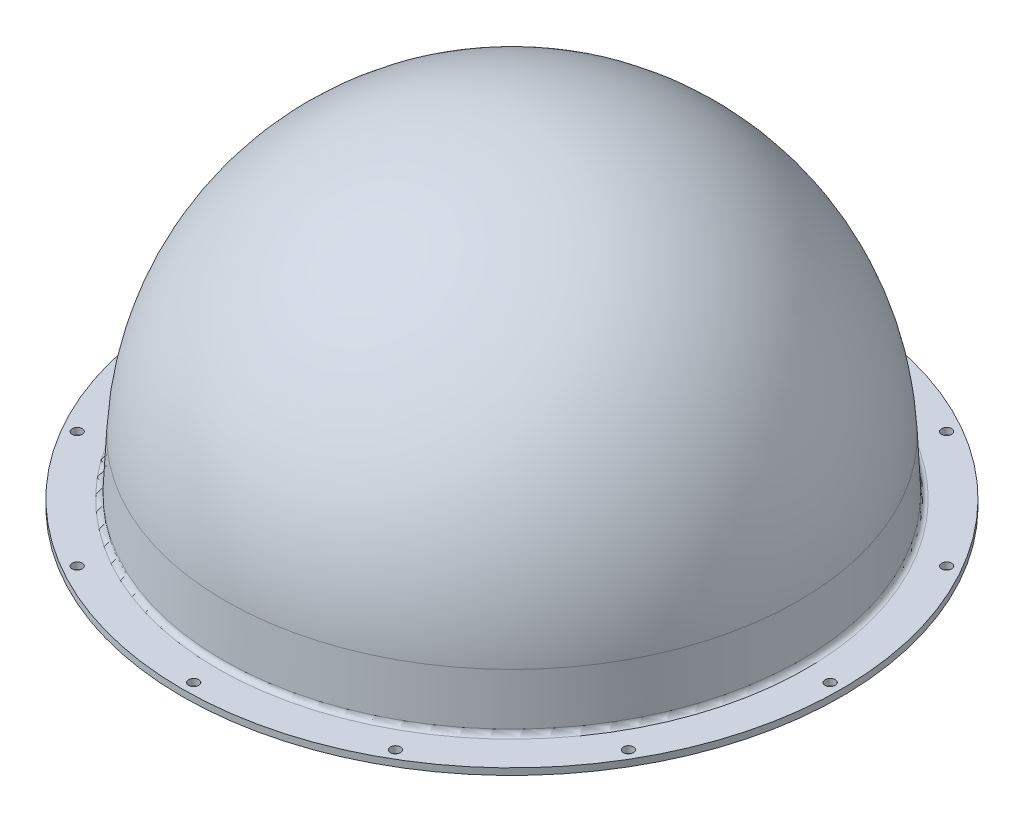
ISO-10303-21;
HEADER;
FILE_DESCRIPTION(('STEP AP214'),'2;1');
FILE_NAME('part.step','',(''),(''),'','','');
FILE_SCHEMA(('AUTOMOTIVE_DESIGN { 1 0 10303 214 1 1 1 1 }'));
ENDSEC;
DATA;
#1=APPLICATION_CONTEXT('core data for automotive mechanical design processes');
#2=APPLICATION_PROTOCOL_DEFINITION('international standard','automotive_design',2000,#1);
#3=PRODUCT_CONTEXT('',#1,'mechanical');
#4=PRODUCT('Part','Part','',(#3));
#5=PRODUCT_RELATED_PRODUCT_CATEGORY('part','',(#4));
#6=PRODUCT_DEFINITION_FORMATION('','',#4);
#7=PRODUCT_DEFINITION_CONTEXT('part definition',#1,'design');
#8=PRODUCT_DEFINITION('design','',#6,#7);
#9=PRODUCT_DEFINITION_SHAPE('','',#8);
#10=(LENGTH_UNIT() NAMED_UNIT(*) SI_UNIT(.MILLI.,.METRE.));
#11=(NAMED_UNIT(*) PLANE_ANGLE_UNIT() SI_UNIT($,.RADIAN.));
#12=(NAMED_UNIT(*) SI_UNIT($,.STERADIAN.) SOLID_ANGLE_UNIT());
#13=UNCERTAINTY_MEASURE_WITH_UNIT(LENGTH_MEASURE(1.E-05),#10,'distance_accuracy_value','');
#14=(GEOMETRIC_REPRESENTATION_CONTEXT(3) GLOBAL_UNCERTAINTY_ASSIGNED_CONTEXT((#13)) GLOBAL_UNIT_ASSIGNED_CONTEXT((#10,
#11,#12)) REPRESENTATION_CONTEXT('',''));
#15=CARTESIAN_POINT('',(0.,0.,0.));
#16=DIRECTION('',(0.,0.,1.));
#17=DIRECTION('',(1.,0.,0.));
#18=AXIS2_PLACEMENT_3D('',#15,#16,#17);
#19=CARTESIAN_POINT('',(0.,0.,0.));
#20=DIRECTION('',(0.,1.,0.));
#21=DIRECTION('',(0.,0.,1.));
#22=AXIS2_PLACEMENT_3D('',#19,#20,#21);
#23=CYLINDRICAL_SURFACE('',#22,108.27);
#24=CARTESIAN_POINT('',(0.,2.15999999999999,0.));
#25=DIRECTION('',(0.,1.,0.));
#26=DIRECTION('',(0.,0.,1.));
#27=AXIS2_PLACEMENT_3D('',#24,#25,#26);
#28=CIRCLE('',#27,108.27);
#29=CARTESIAN_POINT('',(0.,2.15999999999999,108.27));
#30=VERTEX_POINT('',#29);
#31=EDGE_CURVE('E58',#30,#30,#28,.T.);
#32=ORIENTED_EDGE('',*,*,#31,.F.);
#33=EDGE_LOOP('',(#32));
#34=FACE_BOUND('',#33,.T.);
#35=CARTESIAN_POINT('',(0.,0.,0.));
#36=DIRECTION('',(0.,1.,0.));
#37=DIRECTION('',(0.,0.,1.));
#38=AXIS2_PLACEMENT_3D('',#35,#36,#37);
#39=CIRCLE('',#38,108.27);
#40=CARTESIAN_POINT('',(0.,0.,108.27));
#41=VERTEX_POINT('',#40);
#42=EDGE_CURVE('E10',#41,#41,#39,.T.);
#43=ORIENTED_EDGE('',*,*,#42,.T.);
#44=EDGE_LOOP('',(#43));
#45=FACE_BOUND('',#44,.T.);
#46=ADVANCED_FACE('F30',(#34,#45),#23,.T.);
#47=CARTESIAN_POINT('',(95.1934009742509,0.,0.));
#48=DIRECTION('',(0.,1.,0.));
#49=DIRECTION('',(0.,0.,1.));
#50=AXIS2_PLACEMENT_3D('',#47,#48,#49);
#51=PLANE('',#50);
#52=CARTESIAN_POINT('',(-52.2749999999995,0.,-90.5429559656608));
#53=DIRECTION('',(0.,1.,0.));
#54=DIRECTION('',(0.,0.,1.));
#55=AXIS2_PLACEMENT_3D('',#52,#53,#54);
#56=CIRCLE('',#55,1.65000000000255);
#57=CARTESIAN_POINT('',(-52.2749999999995,0.,-88.8929559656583));
#58=VERTEX_POINT('',#57);
#59=EDGE_CURVE('E125',#58,#58,#56,.T.);
#60=ORIENTED_EDGE('',*,*,#59,.T.);
#61=EDGE_LOOP('',(#60));
#62=FACE_BOUND('',#61,.T.);
#63=CARTESIAN_POINT('',(-90.5429559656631,0.,-52.2749999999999));
#64=DIRECTION('',(0.,1.,0.));
#65=DIRECTION('',(0.,0.,1.));
#66=AXIS2_PLACEMENT_3D('',#63,#64,#65);
#67=CIRCLE('',#66,1.65000000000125);
#68=CARTESIAN_POINT('',(-90.5429559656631,0.,-50.6249999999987));
#69=VERTEX_POINT('',#68);
#70=EDGE_CURVE('E119',#69,#69,#67,.T.);
#71=ORIENTED_EDGE('',*,*,#70,.T.);
#72=EDGE_LOOP('',(#71));
#73=FACE_BOUND('',#72,.T.);
#74=CARTESIAN_POINT('',(-104.55,0.,0.));
#75=DIRECTION('',(0.,1.,0.));
#76=DIRECTION('',(0.,0.,1.));
#77=AXIS2_PLACEMENT_3D('',#74,#75,#76);
#78=CIRCLE('',#77,1.65000000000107);
#79=CARTESIAN_POINT('',(-104.55,0.,1.65000000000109));
#80=VERTEX_POINT('',#79);
#81=EDGE_CURVE('E113',#80,#80,#78,.T.);
#82=ORIENTED_EDGE('',*,*,#81,.T.);
#83=EDGE_LOOP('',(#82));
#84=FACE_BOUND('',#83,.T.);
#85=CARTESIAN_POINT('',(-90.542955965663,0.,52.275));
#86=DIRECTION('',(0.,1.,0.));
#87=DIRECTION('',(0.,0.,1.));
#88=AXIS2_PLACEMENT_3D('',#85,#86,#87);
#89=CIRCLE('',#88,1.65000000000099);
#90=CARTESIAN_POINT('',(-90.542955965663,0.,53.925000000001));
#91=VERTEX_POINT('',#90);
#92=EDGE_CURVE('E107',#91,#91,#89,.T.);
#93=ORIENTED_EDGE('',*,*,#92,.T.);
#94=EDGE_LOOP('',(#93));
#95=FACE_BOUND('',#94,.T.);
#96=CARTESIAN_POINT('',(-52.275,0.,90.5429559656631));
#97=DIRECTION('',(0.,1.,0.));
#98=DIRECTION('',(0.,0.,1.));
#99=AXIS2_PLACEMENT_3D('',#96,#97,#98);
#100=CIRCLE('',#99,1.65000000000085);
#101=CARTESIAN_POINT('',(-52.275,0.,92.1929559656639));
#102=VERTEX_POINT('',#101);
#103=EDGE_CURVE('E101',#102,#102,#100,.T.);
#104=ORIENTED_EDGE('',*,*,#103,.T.);
#105=EDGE_LOOP('',(#104));
#106=FACE_BOUND('',#105,.T.);
#107=CARTESIAN_POINT('',(0.,0.,104.55));
#108=DIRECTION('',(0.,1.,0.));
#109=DIRECTION('',(0.,0.,1.));
#110=AXIS2_PLACEMENT_3D('',#107,#108,#109);
#111=CIRCLE('',#110,1.6500000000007);
#112=CARTESIAN_POINT('',(0.,0.,106.200000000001));
#113=VERTEX_POINT('',#112);
#114=EDGE_CURVE('E95',#113,#113,#111,.T.);
#115=ORIENTED_EDGE('',*,*,#114,.T.);
#116=EDGE_LOOP('',(#115));
#117=FACE_BOUND('',#116,.T.);
#118=CARTESIAN_POINT('',(52.275,0.,90.542955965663));
#119=DIRECTION('',(0.,1.,0.));
#120=DIRECTION('',(0.,0.,1.));
#121=AXIS2_PLACEMENT_3D('',#118,#119,#120);
#122=CIRCLE('',#121,1.65000000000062);
#123=CARTESIAN_POINT('',(52.275,0.,92.1929559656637));
#124=VERTEX_POINT('',#123);
#125=EDGE_CURVE('E89',#124,#124,#122,.T.);
#126=ORIENTED_EDGE('',*,*,#125,.T.);
#127=EDGE_LOOP('',(#126));
#128=FACE_BOUND('',#127,.T.);
#129=CARTESIAN_POINT('',(90.5429559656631,0.,52.275));
#130=DIRECTION('',(0.,1.,0.));
#131=DIRECTION('',(0.,0.,1.));
#132=AXIS2_PLACEMENT_3D('',#129,#130,#131);
#133=CIRCLE('',#132,1.6500000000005);
#134=CARTESIAN_POINT('',(90.5429559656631,0.,53.9250000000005));
#135=VERTEX_POINT('',#134);
#136=EDGE_CURVE('E83',#135,#135,#133,.T.);
#137=ORIENTED_EDGE('',*,*,#136,.T.);
#138=EDGE_LOOP('',(#137));
#139=FACE_BOUND('',#138,.T.);
#140=CARTESIAN_POINT('',(104.55,0.,0.));
#141=DIRECTION('',(0.,1.,0.));
#142=DIRECTION('',(0.,0.,1.));
#143=AXIS2_PLACEMENT_3D('',#140,#141,#142);
#144=CIRCLE('',#143,1.65000000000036);
#145=CARTESIAN_POINT('',(104.55,0.,1.65000000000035));
#146=VERTEX_POINT('',#145);
#147=EDGE_CURVE('E77',#146,#146,#144,.T.);
#148=ORIENTED_EDGE('',*,*,#147,.T.);
#149=EDGE_LOOP('',(#148));
#150=FACE_BOUND('',#149,.T.);
#151=CARTESIAN_POINT('',(90.5429559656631,0.,-52.275));
#152=DIRECTION('',(0.,1.,0.));
#153=DIRECTION('',(0.,0.,1.));
#154=AXIS2_PLACEMENT_3D('',#151,#152,#153);
#155=CIRCLE('',#154,1.65000000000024);
#156=CARTESIAN_POINT('',(90.5429559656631,0.,-50.6249999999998));
#157=VERTEX_POINT('',#156);
#158=EDGE_CURVE('E71',#157,#157,#155,.T.);
#159=ORIENTED_EDGE('',*,*,#158,.T.);
#160=EDGE_LOOP('',(#159));
#161=FACE_BOUND('',#160,.T.);
#162=CARTESIAN_POINT('',(52.2750000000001,0.,-90.542955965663));
#163=DIRECTION('',(0.,1.,0.));
#164=DIRECTION('',(0.,0.,1.));
#165=AXIS2_PLACEMENT_3D('',#162,#163,#164);
#166=CIRCLE('',#165,1.65);
#167=CARTESIAN_POINT('',(52.2750000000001,0.,-88.892955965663));
#168=VERTEX_POINT('',#167);
#169=EDGE_CURVE('E65',#168,#168,#166,.T.);
#170=ORIENTED_EDGE('',*,*,#169,.T.);
#171=EDGE_LOOP('',(#170));
#172=FACE_BOUND('',#171,.T.);
#173=CARTESIAN_POINT('',(0.,0.,-104.55));
#174=DIRECTION('',(0.,1.,0.));
#175=DIRECTION('',(0.,0.,1.));
#176=AXIS2_PLACEMENT_3D('',#173,#174,#175);
#177=CIRCLE('',#176,1.65);
#178=CARTESIAN_POINT('',(0.,0.,-102.9));
#179=VERTEX_POINT('',#178);
#180=EDGE_CURVE('E61',#179,#179,#177,.T.);
#181=ORIENTED_EDGE('',*,*,#180,.T.);
#182=EDGE_LOOP('',(#181));
#183=FACE_BOUND('',#182,.T.);
#184=ORIENTED_EDGE('',*,*,#42,.F.);
#185=EDGE_LOOP('',(#184));
#186=FACE_BOUND('',#185,.T.);
#187=CARTESIAN_POINT('',(0.,0.,0.));
#188=DIRECTION('',(0.,1.,0.));
#189=DIRECTION('',(0.,0.,1.));
#190=AXIS2_PLACEMENT_3D('',#187,#188,#189);
#191=CIRCLE('',#190,95.1934009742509);
#192=CARTESIAN_POINT('',(0.,0.,95.1934009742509));
#193=VERTEX_POINT('',#192);
#194=EDGE_CURVE('E36',#193,#193,#191,.T.);
#195=ORIENTED_EDGE('',*,*,#194,.T.);
#196=EDGE_LOOP('',(#195));
#197=FACE_BOUND('',#196,.T.);
#198=ADVANCED_FACE('F134',(#62,#73,#84,#95,#106,#117,#128,#139,#150,#161,#172,#183,#186,#197),
#51,.F.);
#199=CARTESIAN_POINT('',(0.,3.18276284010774,0.));
#200=DIRECTION('',(0.,1.,0.));
#201=DIRECTION('',(0.,0.,1.));
#202=AXIS2_PLACEMENT_3D('',#199,#200,#201);
#203=TOROIDAL_SURFACE('',#202,95.1934009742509,3.18276284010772);
#204=ORIENTED_EDGE('',*,*,#194,.F.);
#205=EDGE_LOOP('',(#204));
#206=FACE_BOUND('',#205,.T.);
#207=CARTESIAN_POINT('',(0.,3.01618990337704,0.));
#208=DIRECTION('',(0.,1.,0.));
#209=DIRECTION('',(0.,0.,1.));
#210=AXIS2_PLACEMENT_3D('',#207,#208,#209);
#211=CIRCLE('',#210,92.015);
#212=CARTESIAN_POINT('',(0.,3.01618990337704,92.015));
#213=VERTEX_POINT('',#212);
#214=EDGE_CURVE('E40',#213,#213,#211,.T.);
#215=ORIENTED_EDGE('',*,*,#214,.T.);
#216=EDGE_LOOP('',(#215));
#217=FACE_BOUND('',#216,.T.);
#218=ADVANCED_FACE('F180',(#206,#217),#203,.T.);
#219=CARTESIAN_POINT('',(0.,20.1900000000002,0.));
#220=DIRECTION('',(0.,-1.,0.));
#221=DIRECTION('',(0.,0.,-1.));
#222=AXIS2_PLACEMENT_3D('',#219,#220,#221);
#223=CONICAL_SURFACE('',#222,91.1149587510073,0.0523598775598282);
#224=ORIENTED_EDGE('',*,*,#214,.F.);
#225=EDGE_LOOP('',(#224));
#226=FACE_BOUND('',#225,.T.);
#227=CARTESIAN_POINT('',(0.,20.1900000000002,0.));
#228=DIRECTION('',(0.,1.,0.));
#229=DIRECTION('',(0.,0.,1.));
#230=AXIS2_PLACEMENT_3D('',#227,#228,#229);
#231=CIRCLE('',#230,91.1149587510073);
#232=CARTESIAN_POINT('',(0.,20.1900000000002,91.1149587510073));
#233=VERTEX_POINT('',#232);
#234=EDGE_CURVE('E44',#233,#233,#231,.T.);
#235=ORIENTED_EDGE('',*,*,#234,.T.);
#236=EDGE_LOOP('',(#235));
#237=FACE_BOUND('',#236,.T.);
#238=ADVANCED_FACE('F184',(#226,#237),#223,.F.);
#239=CARTESIAN_POINT('',(0.,15.4148673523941,0.));
#240=DIRECTION('',(0.,1.,0.));
#241=DIRECTION('',(-1.,0.,0.));
#242=AXIS2_PLACEMENT_3D('',#239,#240,#241);
#243=SPHERICAL_SURFACE('',#242,91.2400000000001);
#244=ORIENTED_EDGE('',*,*,#234,.F.);
#245=EDGE_LOOP('',(#244));
#246=FACE_BOUND('',#245,.T.);
#247=ADVANCED_FACE('F190',(#246),#243,.F.);
#248=CARTESIAN_POINT('',(0.,15.4200976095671,0.));
#249=DIRECTION('',(0.,1.,0.));
#250=DIRECTION('',(1.,0.,0.));
#251=AXIS2_PLACEMENT_3D('',#248,#249,#250);
#252=SPHERICAL_SURFACE('',#251,94.28);
#253=CARTESIAN_POINT('',(0.,20.19,0.));
#254=DIRECTION('',(0.,1.,0.));
#255=DIRECTION('',(0.,0.,1.));
#256=AXIS2_PLACEMENT_3D('',#253,#254,#255);
#257=CIRCLE('',#256,94.1592609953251);
#258=CARTESIAN_POINT('',(0.,20.19,94.1592609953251));
#259=VERTEX_POINT('',#258);
#260=EDGE_CURVE('E49',#259,#259,#257,.T.);
#261=ORIENTED_EDGE('',*,*,#260,.T.);
#262=EDGE_LOOP('',(#261));
#263=FACE_BOUND('',#262,.T.);
#264=ADVANCED_FACE('F194',(#263),#252,.T.);
#265=CARTESIAN_POINT('',(0.,3.79097034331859,0.));
#266=DIRECTION('',(0.,-1.,0.));
#267=DIRECTION('',(0.,0.,-1.));
#268=AXIS2_PLACEMENT_3D('',#265,#266,#267);
#269=CONICAL_SURFACE('',#268,94.99,0.0506145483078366);
#270=ORIENTED_EDGE('',*,*,#260,.F.);
#271=EDGE_LOOP('',(#270));
#272=FACE_BOUND('',#271,.T.);
#273=CARTESIAN_POINT('',(0.,3.79097034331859,0.));
#274=DIRECTION('',(0.,1.,0.));
#275=DIRECTION('',(0.,0.,1.));
#276=AXIS2_PLACEMENT_3D('',#273,#274,#275);
#277=CIRCLE('',#276,94.99);
#278=CARTESIAN_POINT('',(0.,3.79097034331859,94.99));
#279=VERTEX_POINT('',#278);
#280=EDGE_CURVE('E52',#279,#279,#277,.T.);
#281=ORIENTED_EDGE('',*,*,#280,.T.);
#282=EDGE_LOOP('',(#281));
#283=FACE_BOUND('',#282,.T.);
#284=ADVANCED_FACE('F198',(#272,#283),#269,.T.);
#285=CARTESIAN_POINT('',(0.,3.87788310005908,0.));
#286=DIRECTION('',(0.,1.,0.));
#287=DIRECTION('',(0.,0.,1.));
#288=AXIS2_PLACEMENT_3D('',#285,#286,#287);
#289=TOROIDAL_SURFACE('',#288,96.7056831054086,1.7178831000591);
#290=ORIENTED_EDGE('',*,*,#280,.F.);
#291=EDGE_LOOP('',(#290));
#292=FACE_BOUND('',#291,.T.);
#293=CARTESIAN_POINT('',(0.,2.15999999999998,0.));
#294=DIRECTION('',(0.,1.,0.));
#295=DIRECTION('',(0.,0.,1.));
#296=AXIS2_PLACEMENT_3D('',#293,#294,#295);
#297=CIRCLE('',#296,96.7056831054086);
#298=CARTESIAN_POINT('',(0.,2.15999999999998,96.7056831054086));
#299=VERTEX_POINT('',#298);
#300=EDGE_CURVE('E55',#299,#299,#297,.T.);
#301=ORIENTED_EDGE('',*,*,#300,.T.);
#302=EDGE_LOOP('',(#301));
#303=FACE_BOUND('',#302,.T.);
#304=ADVANCED_FACE('F148',(#292,#303),#289,.F.);
#305=CARTESIAN_POINT('',(108.27,2.15999999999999,0.));
#306=DIRECTION('',(0.,-1.,0.));
#307=DIRECTION('',(0.,0.,-1.));
#308=AXIS2_PLACEMENT_3D('',#305,#306,#307);
#309=PLANE('',#308);
#310=CARTESIAN_POINT('',(-52.2749999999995,2.15999999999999,-90.5429559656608));
#311=DIRECTION('',(0.,1.,0.));
#312=DIRECTION('',(0.,0.,1.));
#313=AXIS2_PLACEMENT_3D('',#310,#311,#312);
#314=CIRCLE('',#313,1.65000000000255);
#315=CARTESIAN_POINT('',(-52.2749999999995,2.15999999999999,-88.8929559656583));
#316=VERTEX_POINT('',#315);
#317=EDGE_CURVE('E128',#316,#316,#314,.T.);
#318=ORIENTED_EDGE('',*,*,#317,.F.);
#319=EDGE_LOOP('',(#318));
#320=FACE_BOUND('',#319,.T.);
#321=CARTESIAN_POINT('',(-90.5429559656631,2.15999999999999,-52.2749999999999));
#322=DIRECTION('',(0.,1.,0.));
#323=DIRECTION('',(0.,0.,1.));
#324=AXIS2_PLACEMENT_3D('',#321,#322,#323);
#325=CIRCLE('',#324,1.65000000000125);
#326=CARTESIAN_POINT('',(-90.5429559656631,2.15999999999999,-50.6249999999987));
#327=VERTEX_POINT('',#326);
#328=EDGE_CURVE('E122',#327,#327,#325,.T.);
#329=ORIENTED_EDGE('',*,*,#328,.F.);
#330=EDGE_LOOP('',(#329));
#331=FACE_BOUND('',#330,.T.);
#332=CARTESIAN_POINT('',(-104.55,2.15999999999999,0.));
#333=DIRECTION('',(0.,1.,0.));
#334=DIRECTION('',(0.,0.,1.));
#335=AXIS2_PLACEMENT_3D('',#332,#333,#334);
#336=CIRCLE('',#335,1.65000000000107);
#337=CARTESIAN_POINT('',(-104.55,2.15999999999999,1.65000000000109));
#338=VERTEX_POINT('',#337);
#339=EDGE_CURVE('E116',#338,#338,#336,.T.);
#340=ORIENTED_EDGE('',*,*,#339,.F.);
#341=EDGE_LOOP('',(#340));
#342=FACE_BOUND('',#341,.T.);
#343=CARTESIAN_POINT('',(-90.542955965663,2.15999999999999,52.275));
#344=DIRECTION('',(0.,1.,0.));
#345=DIRECTION('',(0.,0.,1.));
#346=AXIS2_PLACEMENT_3D('',#343,#344,#345);
#347=CIRCLE('',#346,1.65000000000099);
#348=CARTESIAN_POINT('',(-90.542955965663,2.15999999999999,53.925000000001));
#349=VERTEX_POINT('',#348);
#350=EDGE_CURVE('E110',#349,#349,#347,.T.);
#351=ORIENTED_EDGE('',*,*,#350,.F.);
#352=EDGE_LOOP('',(#351));
#353=FACE_BOUND('',#352,.T.);
#354=CARTESIAN_POINT('',(-52.275,2.15999999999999,90.5429559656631));
#355=DIRECTION('',(0.,1.,0.));
#356=DIRECTION('',(0.,0.,1.));
#357=AXIS2_PLACEMENT_3D('',#354,#355,#356);
#358=CIRCLE('',#357,1.65000000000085);
#359=CARTESIAN_POINT('',(-52.275,2.15999999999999,92.1929559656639));
#360=VERTEX_POINT('',#359);
#361=EDGE_CURVE('E104',#360,#360,#358,.T.);
#362=ORIENTED_EDGE('',*,*,#361,.F.);
#363=EDGE_LOOP('',(#362));
#364=FACE_BOUND('',#363,.T.);
#365=CARTESIAN_POINT('',(0.,2.15999999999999,104.55));
#366=DIRECTION('',(0.,1.,0.));
#367=DIRECTION('',(0.,0.,1.));
#368=AXIS2_PLACEMENT_3D('',#365,#366,#367);
#369=CIRCLE('',#368,1.6500000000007);
#370=CARTESIAN_POINT('',(0.,2.15999999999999,106.200000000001));
#371=VERTEX_POINT('',#370);
#372=EDGE_CURVE('E98',#371,#371,#369,.T.);
#373=ORIENTED_EDGE('',*,*,#372,.F.);
#374=EDGE_LOOP('',(#373));
#375=FACE_BOUND('',#374,.T.);
#376=CARTESIAN_POINT('',(52.275,2.15999999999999,90.542955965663));
#377=DIRECTION('',(0.,1.,0.));
#378=DIRECTION('',(0.,0.,1.));
#379=AXIS2_PLACEMENT_3D('',#376,#377,#378);
#380=CIRCLE('',#379,1.65000000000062);
#381=CARTESIAN_POINT('',(52.275,2.15999999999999,92.1929559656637));
#382=VERTEX_POINT('',#381);
#383=EDGE_CURVE('E92',#382,#382,#380,.T.);
#384=ORIENTED_EDGE('',*,*,#383,.F.);
#385=EDGE_LOOP('',(#384));
#386=FACE_BOUND('',#385,.T.);
#387=CARTESIAN_POINT('',(90.5429559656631,2.15999999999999,52.275));
#388=DIRECTION('',(0.,1.,0.));
#389=DIRECTION('',(0.,0.,1.));
#390=AXIS2_PLACEMENT_3D('',#387,#388,#389);
#391=CIRCLE('',#390,1.6500000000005);
#392=CARTESIAN_POINT('',(90.5429559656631,2.15999999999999,53.9250000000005));
#393=VERTEX_POINT('',#392);
#394=EDGE_CURVE('E86',#393,#393,#391,.T.);
#395=ORIENTED_EDGE('',*,*,#394,.F.);
#396=EDGE_LOOP('',(#395));
#397=FACE_BOUND('',#396,.T.);
#398=CARTESIAN_POINT('',(104.55,2.15999999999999,0.));
#399=DIRECTION('',(0.,1.,0.));
#400=DIRECTION('',(0.,0.,1.));
#401=AXIS2_PLACEMENT_3D('',#398,#399,#400);
#402=CIRCLE('',#401,1.65000000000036);
#403=CARTESIAN_POINT('',(104.55,2.15999999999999,1.65000000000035));
#404=VERTEX_POINT('',#403);
#405=EDGE_CURVE('E80',#404,#404,#402,.T.);
#406=ORIENTED_EDGE('',*,*,#405,.F.);
#407=EDGE_LOOP('',(#406));
#408=FACE_BOUND('',#407,.T.);
#409=CARTESIAN_POINT('',(90.5429559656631,2.15999999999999,-52.275));
#410=DIRECTION('',(0.,1.,0.));
#411=DIRECTION('',(0.,0.,1.));
#412=AXIS2_PLACEMENT_3D('',#409,#410,#411);
#413=CIRCLE('',#412,1.65000000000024);
#414=CARTESIAN_POINT('',(90.5429559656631,2.15999999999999,-50.6249999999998));
#415=VERTEX_POINT('',#414);
#416=EDGE_CURVE('E74',#415,#415,#413,.T.);
#417=ORIENTED_EDGE('',*,*,#416,.F.);
#418=EDGE_LOOP('',(#417));
#419=FACE_BOUND('',#418,.T.);
#420=CARTESIAN_POINT('',(52.2750000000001,2.15999999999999,-90.542955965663));
#421=DIRECTION('',(0.,1.,0.));
#422=DIRECTION('',(0.,0.,1.));
#423=AXIS2_PLACEMENT_3D('',#420,#421,#422);
#424=CIRCLE('',#423,1.65);
#425=CARTESIAN_POINT('',(52.2750000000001,2.15999999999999,-88.892955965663));
#426=VERTEX_POINT('',#425);
#427=EDGE_CURVE('E68',#426,#426,#424,.T.);
#428=ORIENTED_EDGE('',*,*,#427,.F.);
#429=EDGE_LOOP('',(#428));
#430=FACE_BOUND('',#429,.T.);
#431=CARTESIAN_POINT('',(0.,2.15999999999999,-104.55));
#432=DIRECTION('',(0.,1.,0.));
#433=DIRECTION('',(0.,0.,1.));
#434=AXIS2_PLACEMENT_3D('',#431,#432,#433);
#435=CIRCLE('',#434,1.65);
#436=CARTESIAN_POINT('',(0.,2.15999999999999,-102.9));
#437=VERTEX_POINT('',#436);
#438=EDGE_CURVE('E62',#437,#437,#435,.T.);
#439=ORIENTED_EDGE('',*,*,#438,.F.);
#440=EDGE_LOOP('',(#439));
#441=FACE_BOUND('',#440,.T.);
#442=ORIENTED_EDGE('',*,*,#300,.F.);
#443=EDGE_LOOP('',(#442));
#444=FACE_BOUND('',#443,.T.);
#445=ORIENTED_EDGE('',*,*,#31,.T.);
#446=EDGE_LOOP('',(#445));
#447=FACE_BOUND('',#446,.T.);
#448=ADVANCED_FACE('F144',(#320,#331,#342,#353,#364,#375,#386,#397,#408,#419,#430,#441,#444,
#447),#309,.F.);
#449=CARTESIAN_POINT('',(0.,0.,-104.55));
#450=DIRECTION('',(0.,1.,0.));
#451=DIRECTION('',(0.,0.,1.));
#452=AXIS2_PLACEMENT_3D('',#449,#450,#451);
#453=CYLINDRICAL_SURFACE('',#452,1.65);
#454=ORIENTED_EDGE('',*,*,#180,.F.);
#455=EDGE_LOOP('',(#454));
#456=FACE_BOUND('',#455,.T.);
#457=ORIENTED_EDGE('',*,*,#438,.T.);
#458=EDGE_LOOP('',(#457));
#459=FACE_BOUND('',#458,.T.);
#460=ADVANCED_FACE('F147',(#456,#459),#453,.F.);
#461=CARTESIAN_POINT('',(52.2750000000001,0.,-90.542955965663));
#462=DIRECTION('',(0.,1.,0.));
#463=DIRECTION('',(0.,0.,1.));
#464=AXIS2_PLACEMENT_3D('',#461,#462,#463);
#465=CYLINDRICAL_SURFACE('',#464,1.65);
#466=ORIENTED_EDGE('',*,*,#169,.F.);
#467=EDGE_LOOP('',(#466));
#468=FACE_BOUND('',#467,.T.);
#469=ORIENTED_EDGE('',*,*,#427,.T.);
#470=EDGE_LOOP('',(#469));
#471=FACE_BOUND('',#470,.T.);
#472=ADVANCED_FACE('F208',(#468,#471),#465,.F.);
#473=CARTESIAN_POINT('',(90.5429559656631,0.,-52.275));
#474=DIRECTION('',(0.,1.,0.));
#475=DIRECTION('',(0.,0.,1.));
#476=AXIS2_PLACEMENT_3D('',#473,#474,#475);
#477=CYLINDRICAL_SURFACE('',#476,1.65000000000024);
#478=ORIENTED_EDGE('',*,*,#158,.F.);
#479=EDGE_LOOP('',(#478));
#480=FACE_BOUND('',#479,.T.);
#481=ORIENTED_EDGE('',*,*,#416,.T.);
#482=EDGE_LOOP('',(#481));
#483=FACE_BOUND('',#482,.T.);
#484=ADVANCED_FACE('F212',(#480,#483),#477,.F.);
#485=CARTESIAN_POINT('',(104.55,0.,0.));
#486=DIRECTION('',(0.,1.,0.));
#487=DIRECTION('',(0.,0.,1.));
#488=AXIS2_PLACEMENT_3D('',#485,#486,#487);
#489=CYLINDRICAL_SURFACE('',#488,1.65000000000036);
#490=ORIENTED_EDGE('',*,*,#147,.F.);
#491=EDGE_LOOP('',(#490));
#492=FACE_BOUND('',#491,.T.);
#493=ORIENTED_EDGE('',*,*,#405,.T.);
#494=EDGE_LOOP('',(#493));
#495=FACE_BOUND('',#494,.T.);
#496=ADVANCED_FACE('F216',(#492,#495),#489,.F.);
#497=CARTESIAN_POINT('',(90.5429559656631,0.,52.275));
#498=DIRECTION('',(0.,1.,0.));
#499=DIRECTION('',(0.,0.,1.));
#500=AXIS2_PLACEMENT_3D('',#497,#498,#499);
#501=CYLINDRICAL_SURFACE('',#500,1.6500000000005);
#502=ORIENTED_EDGE('',*,*,#136,.F.);
#503=EDGE_LOOP('',(#502));
#504=FACE_BOUND('',#503,.T.);
#505=ORIENTED_EDGE('',*,*,#394,.T.);
#506=EDGE_LOOP('',(#505));
#507=FACE_BOUND('',#506,.T.);
#508=ADVANCED_FACE('F220',(#504,#507),#501,.F.);
#509=CARTESIAN_POINT('',(52.275,0.,90.542955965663));
#510=DIRECTION('',(0.,1.,0.));
#511=DIRECTION('',(0.,0.,1.));
#512=AXIS2_PLACEMENT_3D('',#509,#510,#511);
#513=CYLINDRICAL_SURFACE('',#512,1.65000000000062);
#514=ORIENTED_EDGE('',*,*,#125,.F.);
#515=EDGE_LOOP('',(#514));
#516=FACE_BOUND('',#515,.T.);
#517=ORIENTED_EDGE('',*,*,#383,.T.);
#518=EDGE_LOOP('',(#517));
#519=FACE_BOUND('',#518,.T.);
#520=ADVANCED_FACE('F224',(#516,#519),#513,.F.);
#521=CARTESIAN_POINT('',(0.,0.,104.55));
#522=DIRECTION('',(0.,1.,0.));
#523=DIRECTION('',(0.,0.,1.));
#524=AXIS2_PLACEMENT_3D('',#521,#522,#523);
#525=CYLINDRICAL_SURFACE('',#524,1.6500000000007);
#526=ORIENTED_EDGE('',*,*,#114,.F.);
#527=EDGE_LOOP('',(#526));
#528=FACE_BOUND('',#527,.T.);
#529=ORIENTED_EDGE('',*,*,#372,.T.);
#530=EDGE_LOOP('',(#529));
#531=FACE_BOUND('',#530,.T.);
#532=ADVANCED_FACE('F228',(#528,#531),#525,.F.);
#533=CARTESIAN_POINT('',(-52.275,0.,90.5429559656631));
#534=DIRECTION('',(0.,1.,0.));
#535=DIRECTION('',(0.,0.,1.));
#536=AXIS2_PLACEMENT_3D('',#533,#534,#535);
#537=CYLINDRICAL_SURFACE('',#536,1.65000000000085);
#538=ORIENTED_EDGE('',*,*,#103,.F.);
#539=EDGE_LOOP('',(#538));
#540=FACE_BOUND('',#539,.T.);
#541=ORIENTED_EDGE('',*,*,#361,.T.);
#542=EDGE_LOOP('',(#541));
#543=FACE_BOUND('',#542,.T.);
#544=ADVANCED_FACE('F232',(#540,#543),#537,.F.);
#545=CARTESIAN_POINT('',(-90.542955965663,0.,52.275));
#546=DIRECTION('',(0.,1.,0.));
#547=DIRECTION('',(0.,0.,1.));
#548=AXIS2_PLACEMENT_3D('',#545,#546,#547);
#549=CYLINDRICAL_SURFACE('',#548,1.65000000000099);
#550=ORIENTED_EDGE('',*,*,#92,.F.);
#551=EDGE_LOOP('',(#550));
#552=FACE_BOUND('',#551,.T.);
#553=ORIENTED_EDGE('',*,*,#350,.T.);
#554=EDGE_LOOP('',(#553));
#555=FACE_BOUND('',#554,.T.);
#556=ADVANCED_FACE('F236',(#552,#555),#549,.F.);
#557=CARTESIAN_POINT('',(-104.55,0.,0.));
#558=DIRECTION('',(0.,1.,0.));
#559=DIRECTION('',(0.,0.,1.));
#560=AXIS2_PLACEMENT_3D('',#557,#558,#559);
#561=CYLINDRICAL_SURFACE('',#560,1.65000000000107);
#562=ORIENTED_EDGE('',*,*,#81,.F.);
#563=EDGE_LOOP('',(#562));
#564=FACE_BOUND('',#563,.T.);
#565=ORIENTED_EDGE('',*,*,#339,.T.);
#566=EDGE_LOOP('',(#565));
#567=FACE_BOUND('',#566,.T.);
#568=ADVANCED_FACE('F240',(#564,#567),#561,.F.);
#569=CARTESIAN_POINT('',(-90.5429559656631,0.,-52.2749999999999));
#570=DIRECTION('',(0.,1.,0.));
#571=DIRECTION('',(0.,0.,1.));
#572=AXIS2_PLACEMENT_3D('',#569,#570,#571);
#573=CYLINDRICAL_SURFACE('',#572,1.65000000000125);
#574=ORIENTED_EDGE('',*,*,#70,.F.);
#575=EDGE_LOOP('',(#574));
#576=FACE_BOUND('',#575,.T.);
#577=ORIENTED_EDGE('',*,*,#328,.T.);
#578=EDGE_LOOP('',(#577));
#579=FACE_BOUND('',#578,.T.);
#580=ADVANCED_FACE('F140',(#576,#579),#573,.F.);
#581=CARTESIAN_POINT('',(-52.2749999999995,0.,-90.5429559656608));
#582=DIRECTION('',(0.,1.,0.));
#583=DIRECTION('',(0.,0.,1.));
#584=AXIS2_PLACEMENT_3D('',#581,#582,#583);
#585=CYLINDRICAL_SURFACE('',#584,1.65000000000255);
#586=ORIENTED_EDGE('',*,*,#59,.F.);
#587=EDGE_LOOP('',(#586));
#588=FACE_BOUND('',#587,.T.);
#589=ORIENTED_EDGE('',*,*,#317,.T.);
#590=EDGE_LOOP('',(#589));
#591=FACE_BOUND('',#590,.T.);
#592=ADVANCED_FACE('F137',(#588,#591),#585,.F.);
#593=CLOSED_SHELL('',(#46,#198,#218,#238,#247,#264,#284,#304,#448,#460,#472,#484,#496,#508,#520,
#532,#544,#556,#568,#580,#592));
#594=MANIFOLD_SOLID_BREP('B2',#593);
#595=ADVANCED_BREP_SHAPE_REPRESENTATION('',(#18,#594),#14);
#596=SHAPE_DEFINITION_REPRESENTATION(#9,#595);
ENDSEC;
END-ISO-10303-21;
